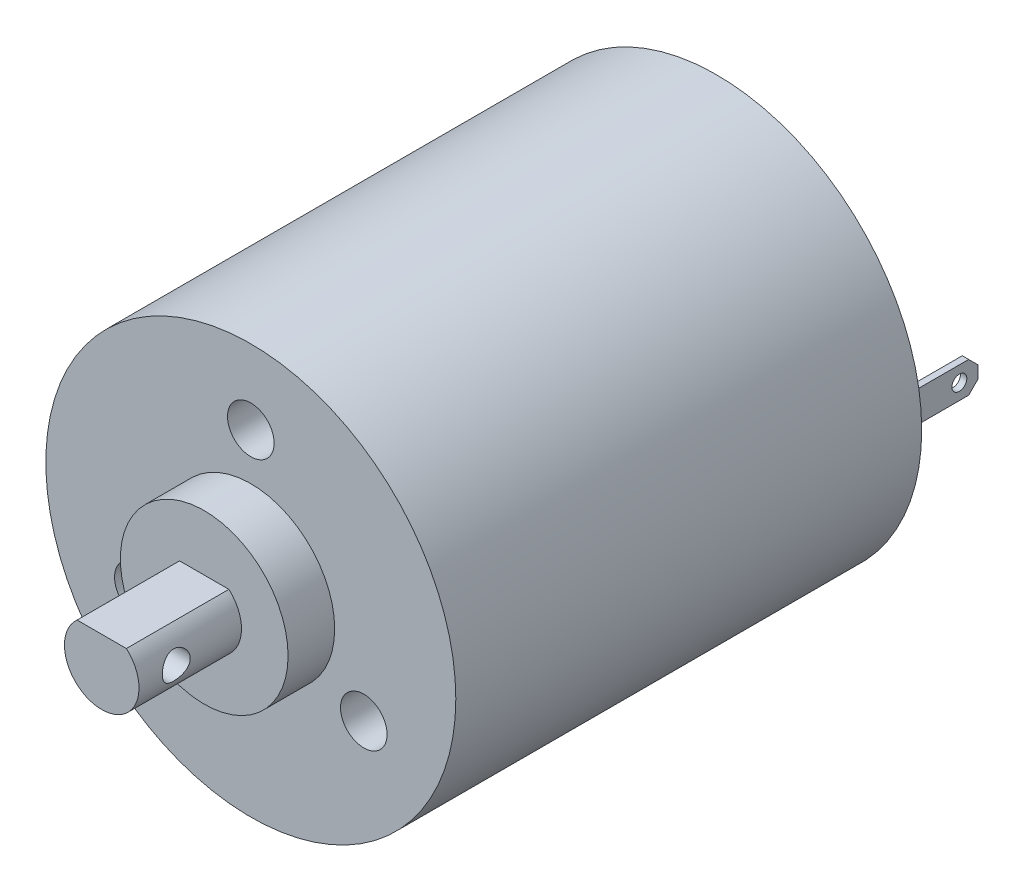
from build123d import *

# Parameters (mm, degrees)
SKETCH1_R               = 11
BASE_EXTRUDE_DEPTH      = 25
BOSS_EXTRUDE1_DEPTH     = 8
SKETCH4_R               = 1.25
CUT_EXTRUDE2_DEPTH      = 4
CIRPATTERN1_COUNT       = 3
SKETCH5_R               = 4.5
BOSS_EXTRUDE2_DEPTH     = 2.5
CUT_EXTRUDE3_DEPTH      = 30.444863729
CUT_EXTRUDE3_DEPTH_BACK = 30.444863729
SKETCH6_R               = 0.75
SKETCH7_W               = 0.344946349
SKETCH7_H               = 1.665238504
EXTRUDE1_DEPTH          = 4.2
SKETCH8_R               = 0.4
CUT_EXTRUDE4_DEPTH      = 38.511625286
CHAMFER1_SIZE           = 0.5


with BuildPart() as part:
    # Sketch1 → Base-Extrude (new body)
    with BuildSketch(Plane.XY):
        Circle(SKETCH1_R)
    extrude(amount=-BASE_EXTRUDE_DEPTH)

    # Sketch2 → Boss-Extrude1 (add)
    with BuildSketch(Plane.XY):
        with BuildLine():
            Line((-1.322875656, 1.5), (1.322875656, 1.5))
            ThreePointArc((1.322875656, 1.5), (0, -2), (-1.322875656, 1.5))
        make_face()
    extrude(amount=BOSS_EXTRUDE1_DEPTH)

    # Sketch4 → Cut-Extrude2 (cut)
    with BuildSketch(Plane.XY):
        with Locations((0, 7)):
            Circle(SKETCH4_R)
    cut_extrude2 = extrude(amount=-CUT_EXTRUDE2_DEPTH, mode=Mode.SUBTRACT)

    # CirPattern1: Cut-Extrude2 ×3 about axis
    cirpattern1_axis = Axis((0, 0, 0), (0, 0, 1))
    for i in range(1, CIRPATTERN1_COUNT):
        add(cut_extrude2.rotate(cirpattern1_axis, i * 360 / CIRPATTERN1_COUNT), mode=Mode.SUBTRACT)

    # Sketch5 → Boss-Extrude2 (add)
    with BuildSketch(Plane.XY):
        Circle(SKETCH5_R)
    extrude(amount=BOSS_EXTRUDE2_DEPTH)

    # Sketch6 → Cut-Extrude3 (cut, two sides: drawn at the far end of the back side and taken through both)
    with BuildSketch(Plane(origin=(0, 0, 0), x_dir=(0, 0, -1), z_dir=(1, 0, 0)).offset(-CUT_EXTRUDE3_DEPTH_BACK)):
        with Locations((-6, 0)):
            Circle(SKETCH6_R)
    extrude(amount=CUT_EXTRUDE3_DEPTH + CUT_EXTRUDE3_DEPTH_BACK, mode=Mode.SUBTRACT)

    # Sketch7 → Extrude1 (add)
    with BuildSketch(Plane(origin=(0, 0, -25), x_dir=(-1, 0, 0), z_dir=(0, 0, -1))):
        with Locations((-9.647758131, 0)):
            Rectangle(SKETCH7_W, SKETCH7_H)
        with Locations((9.647758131, 0)):
            Rectangle(SKETCH7_W, SKETCH7_H)
    extrude(amount=EXTRUDE1_DEPTH)

    # Sketch8 → Cut-Extrude4 (cut, through all)
    with BuildSketch(Plane.ZY.offset(9.820231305)):
        with Locations((-28.2, 0)):
            Circle(SKETCH8_R)
    extrude(amount=-CUT_EXTRUDE4_DEPTH, mode=Mode.SUBTRACT)

    # Chamfer1
    chamfer1_edges = [part.edges().sort_by_distance(p)[0] for p in [
        (9.647758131, -0.832619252, -29.2),
        (9.647758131, 0.832619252, -29.2),
        (-9.647758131, 0.832619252, -29.2),
        (-9.647758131, -0.832619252, -29.2),
    ]]
    chamfer(chamfer1_edges, length=CHAMFER1_SIZE)


solid = part.part
